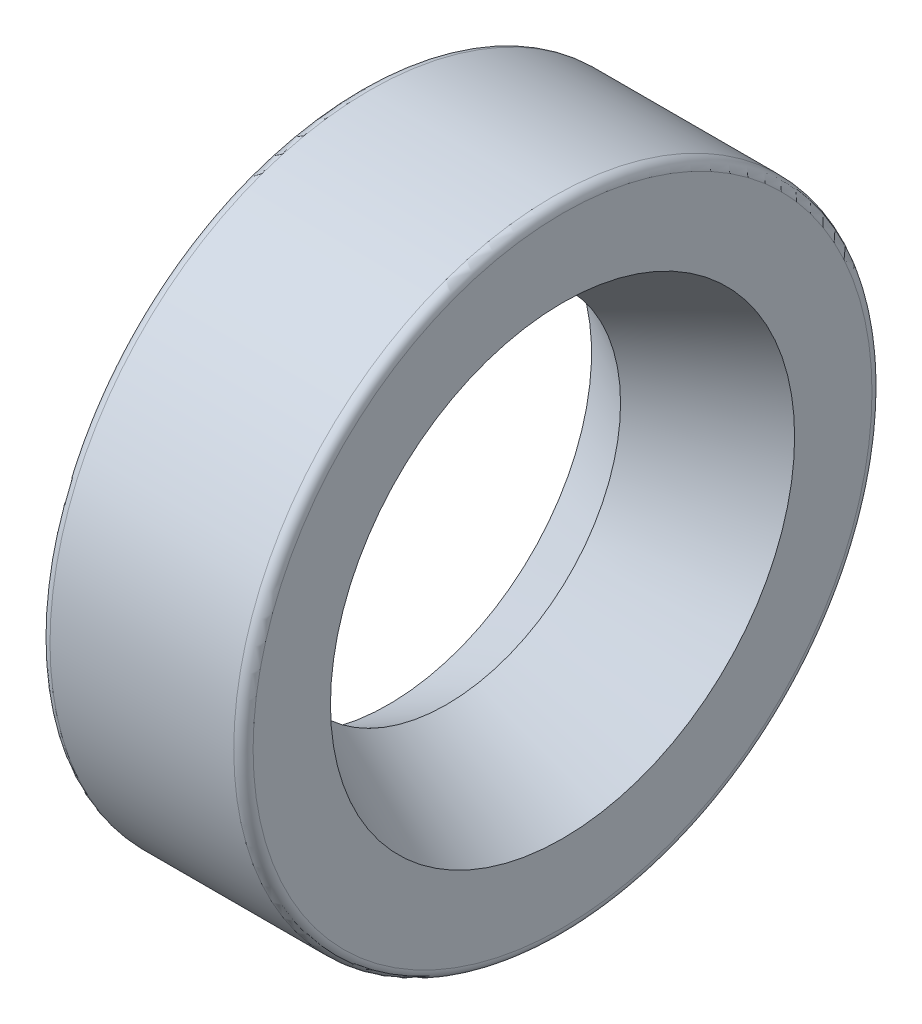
ISO-10303-21;
HEADER;
FILE_DESCRIPTION(('STEP AP214'),'2;1');
FILE_NAME('part.step','',(''),(''),'','','');
FILE_SCHEMA(('AUTOMOTIVE_DESIGN { 1 0 10303 214 1 1 1 1 }'));
ENDSEC;
DATA;
#1=APPLICATION_CONTEXT('core data for automotive mechanical design processes');
#2=APPLICATION_PROTOCOL_DEFINITION('international standard','automotive_design',2000,#1);
#3=PRODUCT_CONTEXT('',#1,'mechanical');
#4=PRODUCT('Part','Part','',(#3));
#5=PRODUCT_RELATED_PRODUCT_CATEGORY('part','',(#4));
#6=PRODUCT_DEFINITION_FORMATION('','',#4);
#7=PRODUCT_DEFINITION_CONTEXT('part definition',#1,'design');
#8=PRODUCT_DEFINITION('design','',#6,#7);
#9=PRODUCT_DEFINITION_SHAPE('','',#8);
#10=(LENGTH_UNIT() NAMED_UNIT(*) SI_UNIT(.MILLI.,.METRE.));
#11=(NAMED_UNIT(*) PLANE_ANGLE_UNIT() SI_UNIT($,.RADIAN.));
#12=(NAMED_UNIT(*) SI_UNIT($,.STERADIAN.) SOLID_ANGLE_UNIT());
#13=UNCERTAINTY_MEASURE_WITH_UNIT(LENGTH_MEASURE(1.E-05),#10,'distance_accuracy_value','');
#14=(GEOMETRIC_REPRESENTATION_CONTEXT(3) GLOBAL_UNCERTAINTY_ASSIGNED_CONTEXT((#13)) GLOBAL_UNIT_ASSIGNED_CONTEXT((#10,
#11,#12)) REPRESENTATION_CONTEXT('',''));
#15=CARTESIAN_POINT('',(0.,0.,0.));
#16=DIRECTION('',(0.,0.,1.));
#17=DIRECTION('',(1.,0.,0.));
#18=AXIS2_PLACEMENT_3D('',#15,#16,#17);
#19=CARTESIAN_POINT('',(-4.,0.,0.));
#20=DIRECTION('',(-1.,0.,0.));
#21=DIRECTION('',(0.,1.,0.));
#22=AXIS2_PLACEMENT_3D('',#19,#20,#21);
#23=TOROIDAL_SURFACE('',#22,8.,1.);
#24=CARTESIAN_POINT('',(-5.,0.,0.));
#25=DIRECTION('',(-1.,0.,0.));
#26=DIRECTION('',(0.,0.,1.));
#27=AXIS2_PLACEMENT_3D('',#24,#25,#26);
#28=CIRCLE('',#27,8.);
#29=CARTESIAN_POINT('',(-5.,0.,8.));
#30=VERTEX_POINT('',#29);
#31=EDGE_CURVE('E104',#30,#30,#28,.T.);
#32=ORIENTED_EDGE('',*,*,#31,.F.);
#33=EDGE_LOOP('',(#32));
#34=FACE_BOUND('',#33,.T.);
#35=CARTESIAN_POINT('',(-3.,0.,0.));
#36=DIRECTION('',(-1.,0.,0.));
#37=DIRECTION('',(0.,0.,1.));
#38=AXIS2_PLACEMENT_3D('',#35,#36,#37);
#39=CIRCLE('',#38,8.);
#40=CARTESIAN_POINT('',(-3.,0.,8.));
#41=VERTEX_POINT('',#40);
#42=EDGE_CURVE('E108',#41,#41,#39,.F.);
#43=ORIENTED_EDGE('',*,*,#42,.F.);
#44=EDGE_LOOP('',(#43));
#45=FACE_BOUND('',#44,.T.);
#46=ADVANCED_FACE('F16',(#34,#45),#23,.T.);
#47=CARTESIAN_POINT('',(0.35,0.,0.));
#48=DIRECTION('',(-1.,0.,0.));
#49=DIRECTION('',(0.,0.,1.));
#50=AXIS2_PLACEMENT_3D('',#47,#48,#49);
#51=CYLINDRICAL_SURFACE('',#50,8.);
#52=CARTESIAN_POINT('',(-2.,0.,0.));
#53=DIRECTION('',(-1.,0.,0.));
#54=DIRECTION('',(0.,0.,1.));
#55=AXIS2_PLACEMENT_3D('',#52,#53,#54);
#56=CIRCLE('',#55,8.);
#57=CARTESIAN_POINT('',(-2.,0.,8.));
#58=VERTEX_POINT('',#57);
#59=EDGE_CURVE('E107',#58,#58,#56,.F.);
#60=ORIENTED_EDGE('',*,*,#59,.F.);
#61=EDGE_LOOP('',(#60));
#62=FACE_BOUND('',#61,.T.);
#63=ORIENTED_EDGE('',*,*,#42,.T.);
#64=EDGE_LOOP('',(#63));
#65=FACE_BOUND('',#64,.T.);
#66=ADVANCED_FACE('F135',(#62,#65),#51,.T.);
#67=CARTESIAN_POINT('',(0.35,0.,0.));
#68=DIRECTION('',(-1.,0.,0.));
#69=DIRECTION('',(0.,0.,1.));
#70=AXIS2_PLACEMENT_3D('',#67,#68,#69);
#71=CYLINDRICAL_SURFACE('',#70,8.);
#72=CARTESIAN_POINT('',(-6.,0.,0.));
#73=DIRECTION('',(-1.,0.,0.));
#74=DIRECTION('',(0.,0.,1.));
#75=AXIS2_PLACEMENT_3D('',#72,#73,#74);
#76=CIRCLE('',#75,8.);
#77=CARTESIAN_POINT('',(-6.,0.,8.));
#78=VERTEX_POINT('',#77);
#79=EDGE_CURVE('E127',#78,#78,#76,.T.);
#80=ORIENTED_EDGE('',*,*,#79,.F.);
#81=EDGE_LOOP('',(#80));
#82=FACE_BOUND('',#81,.T.);
#83=ORIENTED_EDGE('',*,*,#31,.T.);
#84=EDGE_LOOP('',(#83));
#85=FACE_BOUND('',#84,.T.);
#86=ADVANCED_FACE('F138',(#82,#85),#71,.T.);
#87=CARTESIAN_POINT('',(-2.,0.,0.));
#88=DIRECTION('',(-1.,0.,0.));
#89=DIRECTION('',(0.,0.,1.));
#90=AXIS2_PLACEMENT_3D('',#87,#88,#89);
#91=PLANE('',#90);
#92=ORIENTED_EDGE('',*,*,#59,.T.);
#93=EDGE_LOOP('',(#92));
#94=FACE_BOUND('',#93,.T.);
#95=CARTESIAN_POINT('',(-2.,0.,0.));
#96=DIRECTION('',(-1.,0.,0.));
#97=DIRECTION('',(0.,0.,1.));
#98=AXIS2_PLACEMENT_3D('',#95,#96,#97);
#99=CIRCLE('',#98,9.);
#100=CARTESIAN_POINT('',(-2.,0.,9.));
#101=VERTEX_POINT('',#100);
#102=EDGE_CURVE('E124',#101,#101,#99,.F.);
#103=ORIENTED_EDGE('',*,*,#102,.F.);
#104=EDGE_LOOP('',(#103));
#105=FACE_BOUND('',#104,.T.);
#106=ADVANCED_FACE('F132',(#94,#105),#91,.T.);
#107=CARTESIAN_POINT('',(-6.,0.,0.));
#108=DIRECTION('',(-1.,0.,0.));
#109=DIRECTION('',(0.,0.,1.));
#110=AXIS2_PLACEMENT_3D('',#107,#108,#109);
#111=PLANE('',#110);
#112=CARTESIAN_POINT('',(-5.99999999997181,0.,0.));
#113=DIRECTION('',(-1.,0.,0.));
#114=DIRECTION('',(0.,0.,1.));
#115=AXIS2_PLACEMENT_3D('',#112,#113,#114);
#116=CIRCLE('',#115,7.000000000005);
#117=CARTESIAN_POINT('',(-5.99999999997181,0.,7.000000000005));
#118=VERTEX_POINT('',#117);
#119=EDGE_CURVE('E121',#118,#118,#116,.F.);
#120=ORIENTED_EDGE('',*,*,#119,.T.);
#121=EDGE_LOOP('',(#120));
#122=FACE_BOUND('',#121,.T.);
#123=ORIENTED_EDGE('',*,*,#79,.T.);
#124=EDGE_LOOP('',(#123));
#125=FACE_BOUND('',#124,.T.);
#126=ADVANCED_FACE('F224',(#122,#125),#111,.T.);
#127=CARTESIAN_POINT('',(0.35,0.,0.));
#128=DIRECTION('',(-1.,0.,0.));
#129=DIRECTION('',(0.,0.,1.));
#130=AXIS2_PLACEMENT_3D('',#127,#128,#129);
#131=CYLINDRICAL_SURFACE('',#130,9.);
#132=CARTESIAN_POINT('',(-1.,0.,0.));
#133=DIRECTION('',(-1.,0.,0.));
#134=DIRECTION('',(0.,0.,1.));
#135=AXIS2_PLACEMENT_3D('',#132,#133,#134);
#136=CIRCLE('',#135,9.);
#137=CARTESIAN_POINT('',(-1.,0.,9.));
#138=VERTEX_POINT('',#137);
#139=EDGE_CURVE('E103',#138,#138,#136,.F.);
#140=ORIENTED_EDGE('',*,*,#139,.F.);
#141=EDGE_LOOP('',(#140));
#142=FACE_BOUND('',#141,.T.);
#143=ORIENTED_EDGE('',*,*,#102,.T.);
#144=EDGE_LOOP('',(#143));
#145=FACE_BOUND('',#144,.T.);
#146=ADVANCED_FACE('F220',(#142,#145),#131,.T.);
#147=CARTESIAN_POINT('',(-5.99999999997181,0.,0.));
#148=DIRECTION('',(-1.,0.,0.));
#149=DIRECTION('',(0.,0.,1.));
#150=AXIS2_PLACEMENT_3D('',#147,#148,#149);
#151=CONICAL_SURFACE('',#150,7.000000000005,0.463647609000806);
#152=ORIENTED_EDGE('',*,*,#119,.F.);
#153=EDGE_LOOP('',(#152));
#154=FACE_BOUND('',#153,.T.);
#155=CARTESIAN_POINT('',(-4.00000000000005,0.,0.));
#156=DIRECTION('',(1.,0.,0.));
#157=DIRECTION('',(0.,-1.,0.));
#158=AXIS2_PLACEMENT_3D('',#155,#156,#157);
#159=CIRCLE('',#158,6.0000000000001);
#160=CARTESIAN_POINT('',(-4.00000000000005,-6.00000000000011,0.));
#161=VERTEX_POINT('',#160);
#162=EDGE_CURVE('E94',#161,#161,#159,.T.);
#163=ORIENTED_EDGE('',*,*,#162,.T.);
#164=EDGE_LOOP('',(#163));
#165=FACE_BOUND('',#164,.T.);
#166=ADVANCED_FACE('F216',(#154,#165),#151,.F.);
#167=CARTESIAN_POINT('',(-1.,0.,0.));
#168=DIRECTION('',(-1.,0.,0.));
#169=DIRECTION('',(0.,0.,1.));
#170=AXIS2_PLACEMENT_3D('',#167,#168,#169);
#171=PLANE('',#170);
#172=ORIENTED_EDGE('',*,*,#139,.T.);
#173=EDGE_LOOP('',(#172));
#174=FACE_BOUND('',#173,.T.);
#175=CARTESIAN_POINT('',(-1.,0.,0.));
#176=DIRECTION('',(-1.,0.,0.));
#177=DIRECTION('',(0.,0.,1.));
#178=AXIS2_PLACEMENT_3D('',#175,#176,#177);
#179=CIRCLE('',#178,10.);
#180=CARTESIAN_POINT('',(-1.,0.,10.));
#181=VERTEX_POINT('',#180);
#182=EDGE_CURVE('E102',#181,#181,#179,.T.);
#183=ORIENTED_EDGE('',*,*,#182,.T.);
#184=EDGE_LOOP('',(#183));
#185=FACE_BOUND('',#184,.T.);
#186=ADVANCED_FACE('F212',(#174,#185),#171,.T.);
#187=CARTESIAN_POINT('',(0.,0.,0.));
#188=DIRECTION('',(1.,0.,0.));
#189=DIRECTION('',(0.,0.,-1.));
#190=AXIS2_PLACEMENT_3D('',#187,#188,#189);
#191=CONICAL_SURFACE('',#190,7.99999999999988,0.463647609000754);
#192=ORIENTED_EDGE('',*,*,#162,.F.);
#193=EDGE_LOOP('',(#192));
#194=FACE_BOUND('',#193,.T.);
#195=CARTESIAN_POINT('',(0.,0.,0.));
#196=DIRECTION('',(1.,0.,0.));
#197=DIRECTION('',(0.,0.,-1.));
#198=AXIS2_PLACEMENT_3D('',#195,#196,#197);
#199=CIRCLE('',#198,7.99999999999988);
#200=CARTESIAN_POINT('',(0.,0.,-7.99999999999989));
#201=VERTEX_POINT('',#200);
#202=EDGE_CURVE('E114',#201,#201,#199,.T.);
#203=ORIENTED_EDGE('',*,*,#202,.T.);
#204=EDGE_LOOP('',(#203));
#205=FACE_BOUND('',#204,.T.);
#206=ADVANCED_FACE('F208',(#194,#205),#191,.F.);
#207=CARTESIAN_POINT('',(0.35,0.,0.));
#208=DIRECTION('',(-1.,0.,0.));
#209=DIRECTION('',(0.,0.,1.));
#210=AXIS2_PLACEMENT_3D('',#207,#208,#209);
#211=CYLINDRICAL_SURFACE('',#210,10.);
#212=CARTESIAN_POINT('',(-7.,0.,0.));
#213=DIRECTION('',(-1.,0.,0.));
#214=DIRECTION('',(0.,0.,1.));
#215=AXIS2_PLACEMENT_3D('',#212,#213,#214);
#216=CIRCLE('',#215,10.);
#217=CARTESIAN_POINT('',(-7.,0.,10.));
#218=VERTEX_POINT('',#217);
#219=EDGE_CURVE('E111',#218,#218,#216,.F.);
#220=ORIENTED_EDGE('',*,*,#219,.F.);
#221=EDGE_LOOP('',(#220));
#222=FACE_BOUND('',#221,.T.);
#223=ORIENTED_EDGE('',*,*,#182,.F.);
#224=EDGE_LOOP('',(#223));
#225=FACE_BOUND('',#224,.T.);
#226=ADVANCED_FACE('F167',(#222,#225),#211,.F.);
#227=CARTESIAN_POINT('',(0.,0.,0.));
#228=DIRECTION('',(-1.,0.,0.));
#229=DIRECTION('',(0.,0.,1.));
#230=AXIS2_PLACEMENT_3D('',#227,#228,#229);
#231=PLANE('',#230);
#232=ORIENTED_EDGE('',*,*,#202,.F.);
#233=EDGE_LOOP('',(#232));
#234=FACE_BOUND('',#233,.T.);
#235=CARTESIAN_POINT('',(0.,0.,0.));
#236=DIRECTION('',(-1.,0.,0.));
#237=DIRECTION('',(0.,1.,0.));
#238=AXIS2_PLACEMENT_3D('',#235,#236,#237);
#239=CIRCLE('',#238,10.66666666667);
#240=CARTESIAN_POINT('',(0.,10.66666666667,0.));
#241=VERTEX_POINT('',#240);
#242=CARTESIAN_POINT('',(0.,-10.66666666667,0.));
#243=VERTEX_POINT('',#242);
#244=EDGE_CURVE('E51',#241,#243,#239,.T.);
#245=ORIENTED_EDGE('',*,*,#244,.F.);
#246=CARTESIAN_POINT('',(0.,0.,0.));
#247=DIRECTION('',(-1.,0.,0.));
#248=DIRECTION('',(0.,-1.,0.));
#249=AXIS2_PLACEMENT_3D('',#246,#247,#248);
#250=CIRCLE('',#249,10.66666666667);
#251=EDGE_CURVE('E47',#243,#241,#250,.T.);
#252=ORIENTED_EDGE('',*,*,#251,.F.);
#253=EDGE_LOOP('',(#245,#252));
#254=FACE_BOUND('',#253,.T.);
#255=ADVANCED_FACE('F50',(#234,#254),#231,.F.);
#256=CARTESIAN_POINT('',(-7.,0.,0.));
#257=DIRECTION('',(-1.,0.,0.));
#258=DIRECTION('',(0.,0.,1.));
#259=AXIS2_PLACEMENT_3D('',#256,#257,#258);
#260=PLANE('',#259);
#261=ORIENTED_EDGE('',*,*,#219,.T.);
#262=EDGE_LOOP('',(#261));
#263=FACE_BOUND('',#262,.T.);
#264=CARTESIAN_POINT('',(-7.0000000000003,0.,0.));
#265=DIRECTION('',(1.,0.,0.));
#266=DIRECTION('',(0.,-1.,0.));
#267=AXIS2_PLACEMENT_3D('',#264,#265,#266);
#268=CIRCLE('',#267,10.66666666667);
#269=CARTESIAN_POINT('',(-7.00000000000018,-10.66666666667,0.));
#270=VERTEX_POINT('',#269);
#271=CARTESIAN_POINT('',(-7.00000000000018,10.66666666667,0.));
#272=VERTEX_POINT('',#271);
#273=EDGE_CURVE('E34',#270,#272,#268,.T.);
#274=ORIENTED_EDGE('',*,*,#273,.F.);
#275=CARTESIAN_POINT('',(-7.0000000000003,0.,0.));
#276=DIRECTION('',(1.,0.,0.));
#277=DIRECTION('',(0.,1.,0.));
#278=AXIS2_PLACEMENT_3D('',#275,#276,#277);
#279=CIRCLE('',#278,10.66666666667);
#280=EDGE_CURVE('E55',#272,#270,#279,.T.);
#281=ORIENTED_EDGE('',*,*,#280,.F.);
#282=EDGE_LOOP('',(#274,#281));
#283=FACE_BOUND('',#282,.T.);
#284=ADVANCED_FACE('F159',(#263,#283),#260,.T.);
#285=CARTESIAN_POINT('',(-0.3333333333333,0.,0.));
#286=DIRECTION('',(-1.,0.,0.));
#287=DIRECTION('',(0.,1.,0.));
#288=AXIS2_PLACEMENT_3D('',#285,#286,#287);
#289=TOROIDAL_SURFACE('',#288,10.66666666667,0.3333333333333);
#290=CARTESIAN_POINT('',(-0.3333333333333,0.,0.));
#291=DIRECTION('',(-1.,0.,0.));
#292=DIRECTION('',(0.,0.,1.));
#293=AXIS2_PLACEMENT_3D('',#290,#291,#292);
#294=CIRCLE('',#293,11.);
#295=CARTESIAN_POINT('',(-0.3333333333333,0.,11.));
#296=VERTEX_POINT('',#295);
#297=EDGE_CURVE('E27',#296,#296,#294,.T.);
#298=ORIENTED_EDGE('',*,*,#297,.F.);
#299=EDGE_LOOP('',(#298));
#300=FACE_BOUND('',#299,.T.);
#301=ORIENTED_EDGE('',*,*,#251,.T.);
#302=ORIENTED_EDGE('',*,*,#244,.T.);
#303=EDGE_LOOP('',(#301,#302));
#304=FACE_BOUND('',#303,.T.);
#305=ADVANCED_FACE('F58',(#300,#304),#289,.T.);
#306=CARTESIAN_POINT('',(-6.666666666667,0.,0.));
#307=DIRECTION('',(-1.,0.,0.));
#308=DIRECTION('',(0.,1.,0.));
#309=AXIS2_PLACEMENT_3D('',#306,#307,#308);
#310=TOROIDAL_SURFACE('',#309,10.66666666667,0.3333333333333);
#311=ORIENTED_EDGE('',*,*,#273,.T.);
#312=ORIENTED_EDGE('',*,*,#280,.T.);
#313=EDGE_LOOP('',(#311,#312));
#314=FACE_BOUND('',#313,.T.);
#315=CARTESIAN_POINT('',(-6.666666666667,0.,0.));
#316=DIRECTION('',(-1.,0.,0.));
#317=DIRECTION('',(0.,0.,1.));
#318=AXIS2_PLACEMENT_3D('',#315,#316,#317);
#319=CIRCLE('',#318,11.);
#320=CARTESIAN_POINT('',(-6.666666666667,0.,11.));
#321=VERTEX_POINT('',#320);
#322=EDGE_CURVE('E11',#321,#321,#319,.F.);
#323=ORIENTED_EDGE('',*,*,#322,.F.);
#324=EDGE_LOOP('',(#323));
#325=FACE_BOUND('',#324,.T.);
#326=ADVANCED_FACE('F63',(#314,#325),#310,.T.);
#327=CARTESIAN_POINT('',(0.35,0.,0.));
#328=DIRECTION('',(-1.,0.,0.));
#329=DIRECTION('',(0.,0.,1.));
#330=AXIS2_PLACEMENT_3D('',#327,#328,#329);
#331=CYLINDRICAL_SURFACE('',#330,11.);
#332=ORIENTED_EDGE('',*,*,#322,.T.);
#333=EDGE_LOOP('',(#332));
#334=FACE_BOUND('',#333,.T.);
#335=ORIENTED_EDGE('',*,*,#297,.T.);
#336=EDGE_LOOP('',(#335));
#337=FACE_BOUND('',#336,.T.);
#338=ADVANCED_FACE('F18',(#334,#337),#331,.T.);
#339=CLOSED_SHELL('',(#46,#66,#86,#106,#126,#146,#166,#186,#206,#226,#255,#284,#305,#326,#338));
#340=MANIFOLD_SOLID_BREP('B1',#339);
#341=ADVANCED_BREP_SHAPE_REPRESENTATION('',(#18,#340),#14);
#342=SHAPE_DEFINITION_REPRESENTATION(#9,#341);
ENDSEC;
END-ISO-10303-21;
